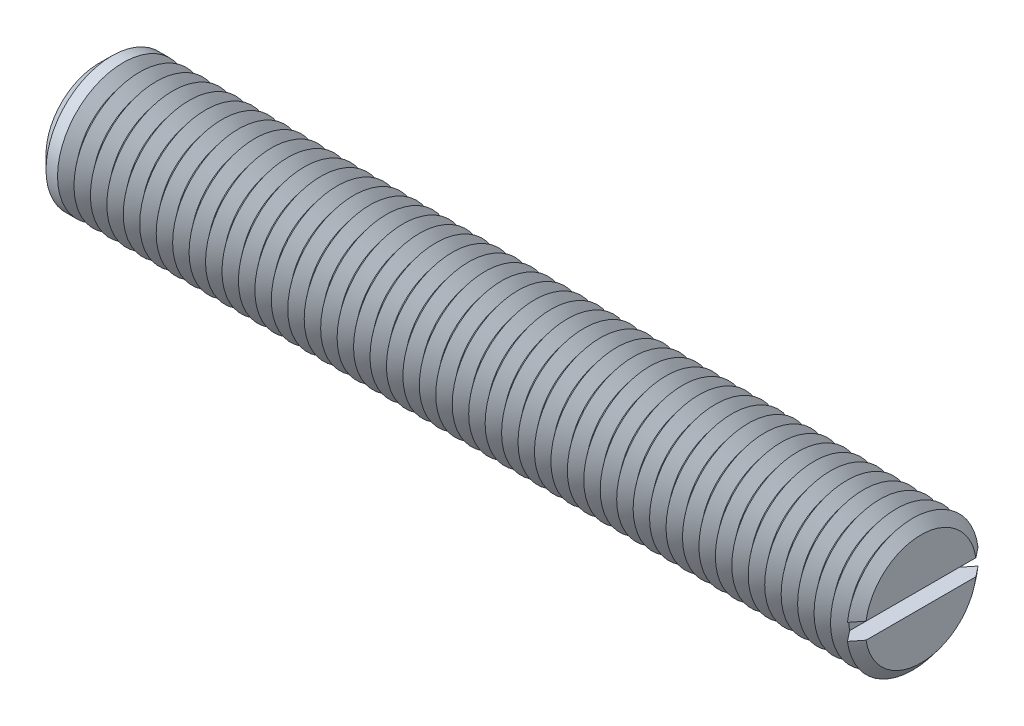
from build123d import *

# Parameters (mm, degrees)
SKETCH1_R       = 8
EXTRUDE1_DEPTH  = 50
SKETCH2_W       = 2
SKETCH2_H       = 2
EXTRUDE2_DEPTH  = 12
CHAMFER1_SIZE   = 1.6
LPATTERN1_COUNT = 49
LPATTERN1_PITCH = 2


with BuildPart() as part:
    # Sketch1 → Extrude1 (new, symmetric)
    with BuildSketch(Plane(origin=(0, 0, 0), x_dir=(0, 0, -1), z_dir=(1, 0, 0))):
        Circle(SKETCH1_R)
    extrude(amount=EXTRUDE1_DEPTH, both=True)

    # Sketch2 → Extrude2 (cut, symmetric)
    with BuildSketch(Plane.XY):
        with Locations((49, 0)):
            Rectangle(SKETCH2_W, SKETCH2_H)
    extrude(amount=EXTRUDE2_DEPTH, both=True, mode=Mode.SUBTRACT)

    # Chamfer1
    chamfer1_edges = [part.edges().sort_by_distance(p)[0] for p in [
        (-50, 0, 8),
    ]]
    chamfer(chamfer1_edges, length=CHAMFER1_SIZE)

    # Sketch3 → Cut-Revolve1 (revolve, cut)
    with BuildSketch(Plane.XY, mode=Mode.PRIVATE) as cut_revolve1_sk:
        Polygon((49, -8), (51, -8), (50, -6.7510004), align=None)
    cut_revolve1 = revolve(cut_revolve1_sk.sketch.rotate(Axis((0, 0, 0), (1, 0, 0)), 277.180755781), axis=Axis((0, 0, 0), (1, 0, 0)), mode=Mode.SUBTRACT)

    # LPattern1: Cut-Revolve1 ×49
    with Locations(*[(-i * LPATTERN1_PITCH, 0, 0) for i in range(1, LPATTERN1_COUNT)]):
        add(cut_revolve1, mode=Mode.SUBTRACT)


solid = part.part
